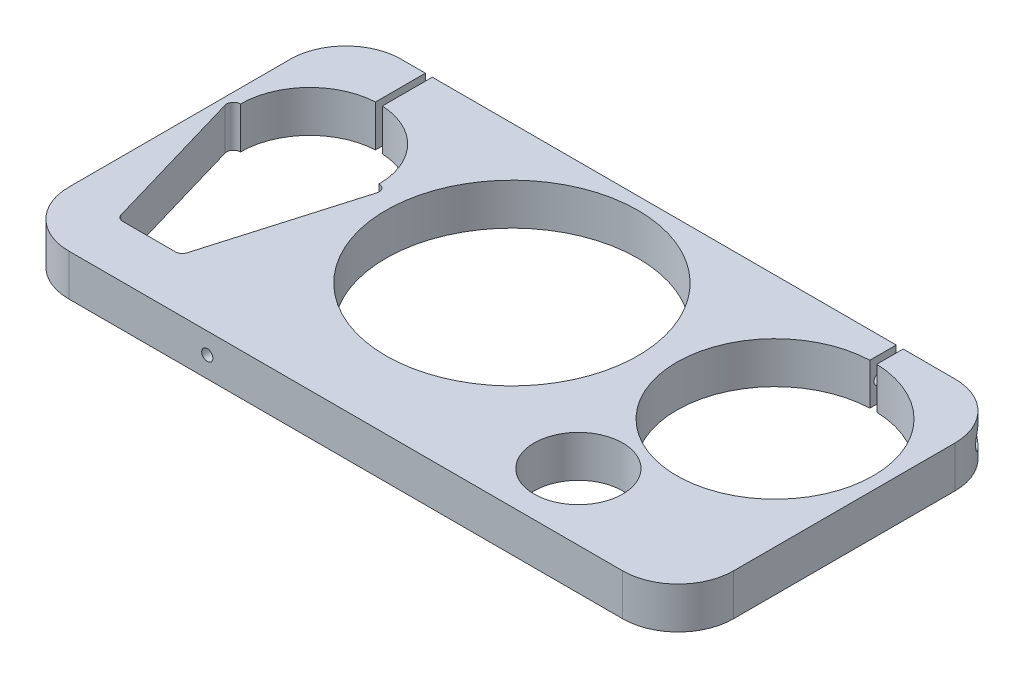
from build123d import *

# Parameters (mm, degrees)
SKETCH1_R                 = 31.75
SKETCH1_R_2               = 45.085
SKETCH1_R_3               = 3.2639
SKETCH1_R_4               = 12.7
MANIFOLD_PLATE_DEPTH      = 9.525
SKETCH6_R                 = 57.785
HOUSINGRECESS_DEPTH       = 0.7874
SKETCH56_R                = 2.5527
SIDESCREWHOLES_DEPTH      = 17.78
CABLEGUIDEHOLES_START     = -22.86
SKETCH81_R                = 2.5527
CABLEGUIDEHOLES_DEPTH     = 22.86
SKETCH68_R                = 57.785
SKETCH68_R_2              = 20.32
SKETCH68_W                = 3.175
SKETCH68_H                = 57.15
BOTTOMPLATE_CUTOUTS_DEPTH = 342.308808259


with BuildPart() as part:
    # Sketch1 → Manifold Plate (new, symmetric)
    with BuildSketch(Plane.XZ):
        with BuildLine():
            Line((25.4, 0), (279.4, 0))
            ThreePointArc((279.4, 0), (297.360512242, -7.439487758), (304.8, -25.4))
            Line((304.8, -25.4), (304.8, -96.8375))
            Line((304.8, -96.8375), (304.8, -127))
            ThreePointArc((304.8, -127), (297.360512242, -144.960512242), (279.4, -152.4))
            Line((279.4, -152.4), (25.4, -152.4))
            ThreePointArc((25.4, -152.4), (7.439487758, -144.960512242), (0, -127))
            Line((0, -127), (0, -96.8375))
            Line((0, -96.8375), (0, -25.4))
            ThreePointArc((0, -25.4), (7.439487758, -7.439487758), (25.4, 0))
        make_face()
        with Locations(Location((38.1, -97.79, 0), (0, 0, 90))):
            Circle(SKETCH1_R, mode=Mode.SUBTRACT)
        with Locations(Location((254, -95.25, 0), (0, 0, 90))):
            Circle(SKETCH1_R_2, mode=Mode.SUBTRACT)
        with Locations(Location((107.95, -120.65, 0), (0, 0, 90))):
            Circle(SKETCH1_R_3, mode=Mode.SUBTRACT)
        with Locations(Location((171.45, -120.65, 0), (0, 0, 90))):
            Circle(SKETCH1_R_3, mode=Mode.SUBTRACT)
        with Locations(Location((171.45, -57.15, 0), (0, 0, 90))):
            Circle(SKETCH1_R_3, mode=Mode.SUBTRACT)
        with Locations(Location((107.95, -57.15, 0), (0, 0, 90))):
            Circle(SKETCH1_R_3, mode=Mode.SUBTRACT)
        with Locations(Location((104.775, -88.9, 0), (0, 0, 90))):
            Circle(SKETCH1_R_4, mode=Mode.SUBTRACT)
        with Locations(Location((174.625, -88.9, 0), (0, 0, 90))):
            Circle(SKETCH1_R_4, mode=Mode.SUBTRACT)
    extrude(amount=MANIFOLD_PLATE_DEPTH, both=True)

    # Sketch6 → HousingRecess (cut)
    with BuildSketch(Plane.XZ.offset(9.525)):
        with Locations(Location((139.7, -88.9, 0), (0, 0, 270))):
            Circle(SKETCH6_R)
    extrude(amount=-HOUSINGRECESS_DEPTH, mode=Mode.SUBTRACT)

    # Sketch56 → SideScrewHoles (cut)
    with BuildSketch(Plane(origin=(0, 0, -152.4), x_dir=(-1, 0, 0), z_dir=(0, 0, -1))):
        with Locations((-88.9, 0)):
            Circle(SKETCH56_R)
        with Locations((-190.5, 0)):
            Circle(SKETCH56_R)
    extrude(amount=-SIDESCREWHOLES_DEPTH, mode=Mode.SUBTRACT)

    # Sketch81 → CableGuideHoles (cut)
    with BuildSketch(Plane.XY.offset(CABLEGUIDEHOLES_START)):
        with Locations(Location((88.9, 0, 0), (0, 0, 180))):
            Circle(SKETCH81_R)
    extrude(amount=CABLEGUIDEHOLES_DEPTH, mode=Mode.SUBTRACT)

    # PinchScrew → Pinch Screws (revolve, cut)
    with BuildSketch(Plane(origin=(152.4, -7.62, -144.78), x_dir=(0, 1, 0), z_dir=(0, 0, 1))):
        Polygon((7.62, 88.9), (5.0673, 88.9), (5.0673, 114.3), (4.3561, 114.3), (4.3561, 133.35), (2.8575, 133.35), (2.8575, 152.4), (7.62, 152.4), align=None)
        Polygon((7.62, -152.4), (7.62, -76.2), (5.0673, -76.2), (5.0673, -101.6), (4.3561, -101.6), (4.3561, -120.65), (2.8575, -120.65), (2.8575, -152.4), align=None)
    revolve(axis=Axis((-26.500749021, 0, -144.78), (1, 0, 0)), mode=Mode.SUBTRACT)

    # Sketch68 → BottomPlate Cutouts (cut, through all)
    with BuildSketch(Plane(origin=(0, 9.525, 0), x_dir=(1, 0, 0), z_dir=(0, 1, 0))):
        with Locations(Location((139.7, 88.9, 0), (0, 0, 90))):
            Circle(SKETCH68_R)
        with Locations(Location((228.6, 30.48, 0), (0, 0, 270))):
            Circle(SKETCH68_R_2)
        with BuildLine():
            Line((36.5125, 152.4), (39.6875, 152.4))
            Line((39.6875, 152.4), (39.6875, 97.79))
            Line((39.6875, 97.79), (69.85, 97.79))
            ThreePointArc((69.85, 97.79), (72.390689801, 96.519079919), (72.897355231, 93.723792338))
            Line((72.897355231, 93.723792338), (53.212355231, 26.413792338))
            ThreePointArc((53.212355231, 26.413792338), (52.069079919, 24.764310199), (50.165, 24.13))
            Line((50.165, 24.13), (26.035, 24.13))
            ThreePointArc((26.035, 24.13), (24.130920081, 24.764310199), (22.987644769, 26.413792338))
            Line((22.987644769, 26.413792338), (3.302644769, 93.723792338))
            ThreePointArc((3.302644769, 93.723792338), (3.809310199, 96.519079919), (6.35, 97.79))
            Line((6.35, 97.79), (36.5125, 97.79))
            Line((36.5125, 97.79), (36.5125, 152.4))
        make_face()
        with Locations((254, 123.825)):
            Rectangle(SKETCH68_W, SKETCH68_H)
    extrude(amount=-BOTTOMPLATE_CUTOUTS_DEPTH, mode=Mode.SUBTRACT)


solid = part.part
